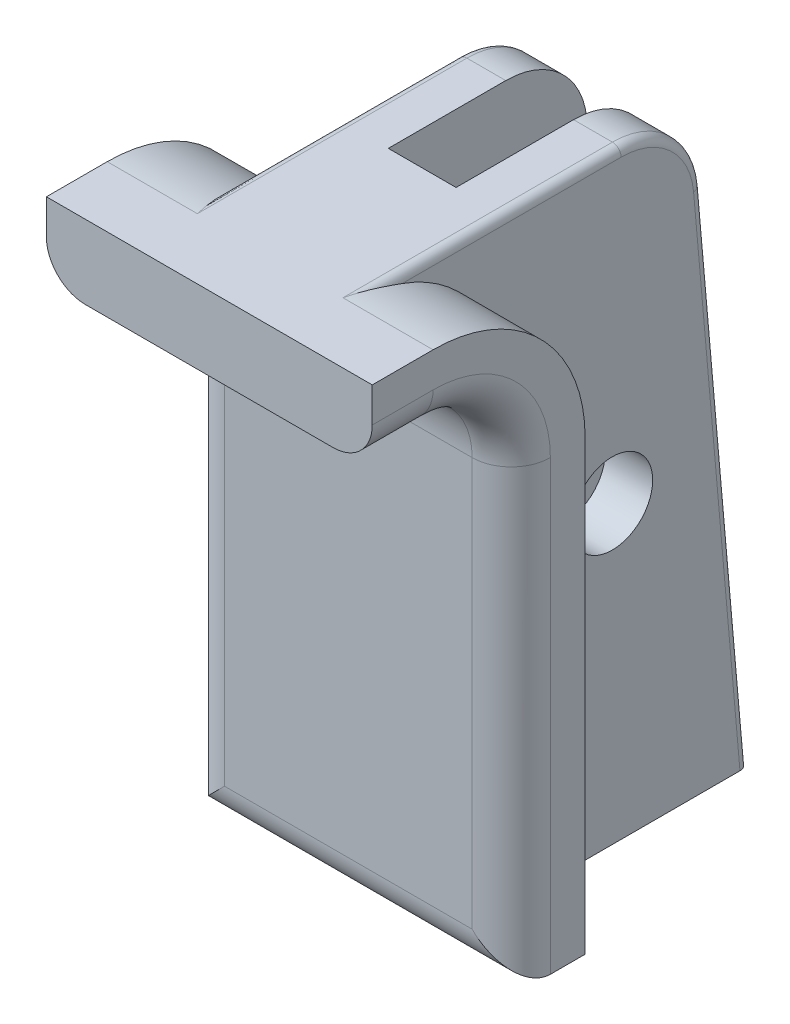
from build123d import *

# Parameters (mm, degrees)
BOSS_EXTRUDE1_DEPTH             = 2.38125
BOSS_EXTRUDE2_DEPTH             = 4.7625
BOSS_EXTRUDE3_REACH             = 21.523
BOSS_EXTRUDE3_DIRECTION_2_REACH = 21.523
FILLET1_R                       = 1.143
FILLET2_R                       = 0.254
SKETCH4_W                       = 1.9812
SKETCH4_H                       = 10.444700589
CUT_EXTRUDE1_DEPTH              = 20.523006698
SKETCH5_R                       = 1.1811
CUT_EXTRUDE2_DEPTH              = 21.236095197


with BuildPart() as part:
    # Sketch1 → Boss-Extrude1 (new, symmetric)
    with BuildSketch(Plane(origin=(0, 0, 0), x_dir=(0, 0, -1), z_dir=(1, 0, 0))):
        with BuildLine():
            Line((0, 0), (0, 17.526))
            Line((0, 17.526), (3.433378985, 17.526))
            ThreePointArc((3.433378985, 17.526), (5.0413291, 16.901123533), (5.805377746, 15.354448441))
            Line((5.805377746, 15.354448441), (7.1628, 0))
            Line((7.1628, 0), (0, 0))
        make_face()
    extrude(amount=BOSS_EXTRUDE1_DEPTH, both=True)

    # Sketch2 → Boss-Extrude2 (add, symmetric)
    with BuildSketch(Plane(origin=(0, 0, 0), x_dir=(0, 0, -1), z_dir=(1, 0, 0))):
        with BuildLine():
            Line((0, 13.081), (0, 0))
            Line((0, 0), (-2.159, 0))
            Line((-2.159, 0), (-2.159, 13.081))
            ThreePointArc((-2.159, 13.081), (-2.828553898, 14.697446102), (-4.445, 15.367))
            Line((-4.445, 15.367), (-6.223, 15.367))
            Line((-6.223, 15.367), (-6.223, 17.526))
            Line((-6.223, 17.526), (-4.445, 17.526))
            ThreePointArc((-4.445, 17.526), (-1.301910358, 16.224089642), (0, 13.081))
        make_face()
    extrude(amount=BOSS_EXTRUDE2_DEPTH, both=True)

    # Boss-Extrude3: up to this face of the body (flat: up to its plane)
    boss_extrude3_end = Plane(part.part.faces().sort_by_distance((2.38125, 8.331879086, -3.192217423))[0])
    # Sketch3 → Boss-Extrude3 (add, up to the picked face)
    with BuildSketch(Plane(origin=(0, 0, 0), x_dir=(0, 0, -1), z_dir=(1, 0, 0)), mode=Mode.PRIVATE) as boss_extrude3_sk1:
        with BuildLine():
            Line((0, 17.526), (0, 13.081))
            ThreePointArc((0, 13.081), (-1.301910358, 16.224089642), (-4.445, 17.526))
            Line((-4.445, 17.526), (0, 17.526))
        make_face()
    boss_extrude3_tool1 = split(extrude(boss_extrude3_sk1.sketch, amount=BOSS_EXTRUDE3_REACH, mode=Mode.PRIVATE), bisect_by=boss_extrude3_end, keep=Keep.BOTH, mode=Mode.PRIVATE)
    add(boss_extrude3_tool1.solids().sort_by(Axis((0, 16.53313, 0.99287), (1, 0, 0)))[0])

    # Boss-Extrude3 direction 2: up to this face of the body (flat: up to its plane)
    boss_extrude3_direction_2_end = Plane(part.part.faces().sort_by_distance((-2.38125, 8.331879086, -3.192217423))[0])
    # Sketch3 → Boss-Extrude3 direction 2 (add, up to the picked face)
    with BuildSketch(Plane(origin=(0, 0, 0), x_dir=(0, 0, -1), z_dir=(1, 0, 0)), mode=Mode.PRIVATE) as boss_extrude3_direction_2_sk1:
        with BuildLine():
            Line((0, 17.526), (0, 13.081))
            ThreePointArc((0, 13.081), (-1.301910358, 16.224089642), (-4.445, 17.526))
            Line((-4.445, 17.526), (0, 17.526))
        make_face()
    boss_extrude3_direction_2_tool1 = split(extrude(boss_extrude3_direction_2_sk1.sketch, amount=-BOSS_EXTRUDE3_DIRECTION_2_REACH, mode=Mode.PRIVATE), bisect_by=boss_extrude3_direction_2_end, keep=Keep.BOTH, mode=Mode.PRIVATE)
    add(boss_extrude3_direction_2_tool1.solids().sort_by(Axis((0, 16.53313, 0.99287), (-1, 0, 0)))[0])

    # Fillet1
    fillet1_edges = [part.edges().sort_by_distance(p)[0] for p in [
        (0, 0, 2.159),
        (-4.7625, 15.367, 5.334),
        (-4.7625, 14.697446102, 2.828553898),
        (-4.7625, 6.5405, 2.159),
        (4.7625, 15.367, 5.334),
        (4.7625, 14.697446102, 2.828553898),
        (4.7625, 6.5405, 2.159),
    ]]
    fillet(fillet1_edges, radius=FILLET1_R)

    # Fillet2
    fillet2_edges = [part.edges().sort_by_distance(p)[0] for p in [
        (2.38125, 16.901123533, -5.0413291),
        (2.38125, 17.526, 0.505810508),
        (-2.38125, 17.526, 0.505810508),
        (-2.38125, 16.901123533, -5.0413291),
        (-2.38125, 7.677224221, -6.484088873),
        (2.38125, 7.677224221, -6.484088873),
    ]]
    fillet(fillet2_edges, radius=FILLET2_R)

    # Sketch4 → Cut-Extrude1 (cut, through all)
    with BuildSketch(Plane.XZ):
        with Locations((0, -5.222350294)):
            Rectangle(SKETCH4_W, SKETCH4_H)
    extrude(amount=-CUT_EXTRUDE1_DEPTH, mode=Mode.SUBTRACT)

    # Sketch5 → Cut-Extrude2 (cut, through all)
    with BuildSketch(Plane(origin=(2.38125, 0, 0), x_dir=(0, 0, -1), z_dir=(1, 0, 0))):
        with Locations((3.175, 8.636)):
            Circle(SKETCH5_R)
    extrude(amount=-CUT_EXTRUDE2_DEPTH, mode=Mode.SUBTRACT)


solid = part.part
